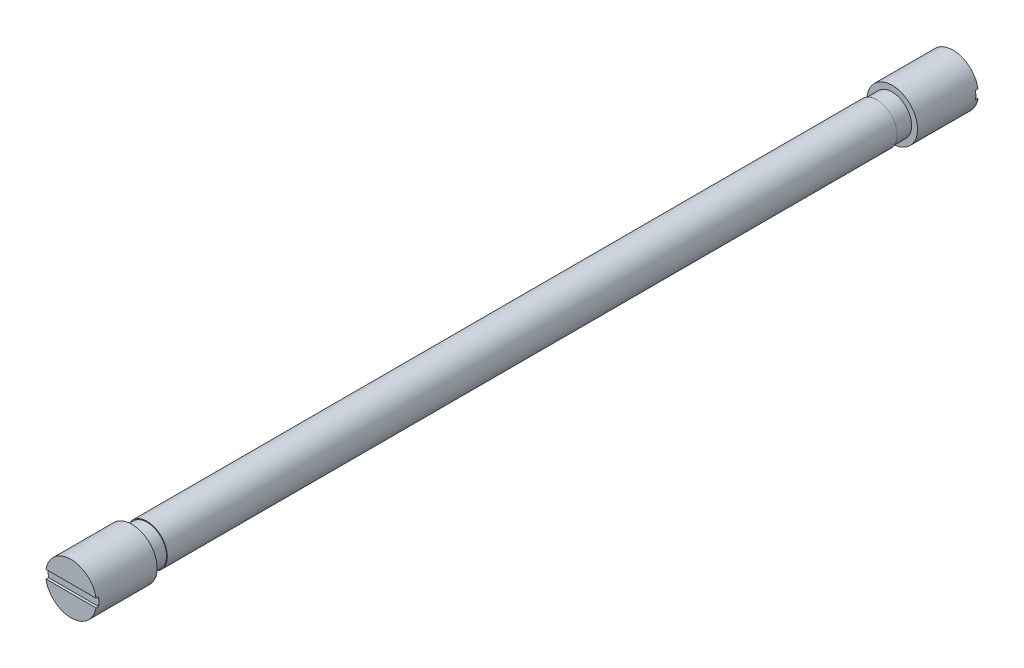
from build123d import *

# Parameters (mm, degrees)
ESQUISSE2_W             = 3
ESQUISSE2_H             = 3.85
ESQUISSE2_W_2           = 51
ESQUISSE2_H_2           = 4
ESQUISSE4_W             = 11.666620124
ESQUISSE4_H             = 1.663113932
ENL_V_MAT_EXTRU_2_DEPTH = 0.5


with BuildPart() as part:
    # Esquisse2 → R_volution1 (revolve)
    with BuildSketch(Plane(origin=(0, 0, 0), x_dir=(0, 0, -1), z_dir=(1, 0, 0)), mode=Mode.PRIVATE) as r_volution1_sk:
        Polygon((-87, 0), (-75, 0), (-75, 3.85), (-75, 5), (-87, 5), align=None)
        with Locations((-73.5, 1.925)):
            Rectangle(ESQUISSE2_W, ESQUISSE2_H)
        Polygon((-72, 3.85), (-72, 0), (-51, 0), (-51, 4), (-72, 4), align=None)
        with Locations((-25.5, 2)):
            Rectangle(ESQUISSE2_W_2, ESQUISSE2_H_2)
        with Locations((25.5, 2)):
            Rectangle(ESQUISSE2_W_2, ESQUISSE2_H_2)
        Polygon((51, 4), (51, 0), (72, 0), (72, 3.85), (72, 4), align=None)
        with Locations((73.5, 1.925)):
            Rectangle(ESQUISSE2_W, ESQUISSE2_H)
        Polygon((75, 3.85), (75, 0), (87, 0), (87, 5), (75, 5), align=None)
    revolve(r_volution1_sk.sketch.rotate(Axis((0, 0, 51), (0, 0, -1)), 90), axis=Axis((0, 0, 51), (0, 0, -1)))

    # Esquisse4 → Enl_v. mat.-Extru.2 (cut)
    with BuildSketch(Plane(origin=(0, 0, -87), x_dir=(-1, 0, 0), z_dir=(0, 0, -1))):
        Rectangle(ESQUISSE4_W, ESQUISSE4_H)
    enl_v_mat_extru_2 = extrude(amount=-ENL_V_MAT_EXTRU_2_DEPTH, mode=Mode.SUBTRACT)

    # Sym_trie2: Enl_v. mat.-Extru.2 across plane
    add(enl_v_mat_extru_2.mirror(Plane.XY), mode=Mode.SUBTRACT)


solid = part.part
